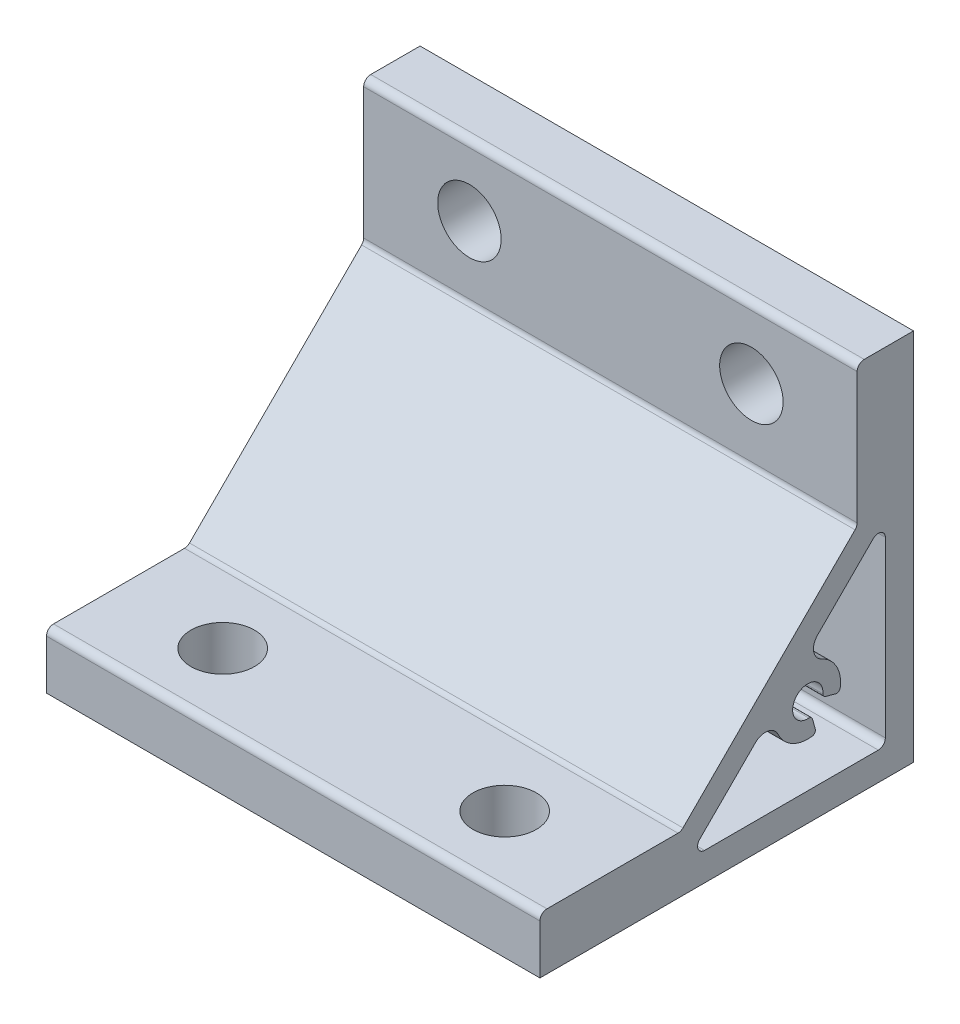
ISO-10303-21;
HEADER;
FILE_DESCRIPTION(('STEP AP214'),'2;1');
FILE_NAME('part.step','',(''),(''),'','','');
FILE_SCHEMA(('AUTOMOTIVE_DESIGN { 1 0 10303 214 1 1 1 1 }'));
ENDSEC;
DATA;
#1=APPLICATION_CONTEXT('core data for automotive mechanical design processes');
#2=APPLICATION_PROTOCOL_DEFINITION('international standard','automotive_design',2000,#1);
#3=PRODUCT_CONTEXT('',#1,'mechanical');
#4=PRODUCT('Part','Part','',(#3));
#5=PRODUCT_RELATED_PRODUCT_CATEGORY('part','',(#4));
#6=PRODUCT_DEFINITION_FORMATION('','',#4);
#7=PRODUCT_DEFINITION_CONTEXT('part definition',#1,'design');
#8=PRODUCT_DEFINITION('design','',#6,#7);
#9=PRODUCT_DEFINITION_SHAPE('','',#8);
#10=(LENGTH_UNIT() NAMED_UNIT(*) SI_UNIT(.MILLI.,.METRE.));
#11=(NAMED_UNIT(*) PLANE_ANGLE_UNIT() SI_UNIT($,.RADIAN.));
#12=(NAMED_UNIT(*) SI_UNIT($,.STERADIAN.) SOLID_ANGLE_UNIT());
#13=UNCERTAINTY_MEASURE_WITH_UNIT(LENGTH_MEASURE(1.E-05),#10,'distance_accuracy_value','');
#14=(GEOMETRIC_REPRESENTATION_CONTEXT(3) GLOBAL_UNCERTAINTY_ASSIGNED_CONTEXT((#13)) GLOBAL_UNIT_ASSIGNED_CONTEXT((#10,
#11,#12)) REPRESENTATION_CONTEXT('',''));
#15=CARTESIAN_POINT('',(0.,0.,0.));
#16=DIRECTION('',(0.,0.,1.));
#17=DIRECTION('',(1.,0.,0.));
#18=AXIS2_PLACEMENT_3D('',#15,#16,#17);
#19=CARTESIAN_POINT('',(35.,7.,52.));
#20=DIRECTION('',(1.,0.,0.));
#21=DIRECTION('',(0.,0.,-1.));
#22=AXIS2_PLACEMENT_3D('',#19,#20,#21);
#23=PLANE('',#22);
#24=DIRECTION('',(0.,-1.,0.));
#25=VECTOR('',#24,1.);
#26=CARTESIAN_POINT('',(35.,0.,53.));
#27=LINE('',#26,#25);
#28=CARTESIAN_POINT('',(35.,7.,53.));
#29=VERTEX_POINT('',#28);
#30=CARTESIAN_POINT('',(35.,0.,53.));
#31=VERTEX_POINT('',#30);
#32=EDGE_CURVE('E362',#29,#31,#27,.T.);
#33=ORIENTED_EDGE('',*,*,#32,.T.);
#34=DIRECTION('',(0.,0.,-1.));
#35=VECTOR('',#34,1.);
#36=CARTESIAN_POINT('',(35.,0.,53.));
#37=LINE('',#36,#35);
#38=CARTESIAN_POINT('',(35.,0.,0.));
#39=VERTEX_POINT('',#38);
#40=EDGE_CURVE('E365',#31,#39,#37,.T.);
#41=ORIENTED_EDGE('',*,*,#40,.T.);
#42=DIRECTION('',(0.,1.,0.));
#43=VECTOR('',#42,1.);
#44=CARTESIAN_POINT('',(35.,0.,0.));
#45=LINE('',#44,#43);
#46=CARTESIAN_POINT('',(35.,53.,0.));
#47=VERTEX_POINT('',#46);
#48=EDGE_CURVE('E368',#39,#47,#45,.T.);
#49=ORIENTED_EDGE('',*,*,#48,.T.);
#50=DIRECTION('',(0.,0.,1.));
#51=VECTOR('',#50,1.);
#52=CARTESIAN_POINT('',(35.,53.,6.99999999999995));
#53=LINE('',#52,#51);
#54=CARTESIAN_POINT('',(35.,53.,6.99999999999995));
#55=VERTEX_POINT('',#54);
#56=EDGE_CURVE('E370',#47,#55,#53,.T.);
#57=ORIENTED_EDGE('',*,*,#56,.T.);
#58=CARTESIAN_POINT('',(35.,52.,6.99999999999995));
#59=DIRECTION('',(1.,0.,0.));
#60=DIRECTION('',(0.,0.,-1.));
#61=AXIS2_PLACEMENT_3D('',#58,#59,#60);
#62=CIRCLE('',#61,1.);
#63=CARTESIAN_POINT('',(35.,52.,7.99999999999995));
#64=VERTEX_POINT('',#63);
#65=EDGE_CURVE('E372',#55,#64,#62,.T.);
#66=ORIENTED_EDGE('',*,*,#65,.T.);
#67=DIRECTION('',(0.,-1.,0.));
#68=VECTOR('',#67,1.);
#69=CARTESIAN_POINT('',(35.,33.4142135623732,7.99999999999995));
#70=LINE('',#69,#68);
#71=CARTESIAN_POINT('',(35.,33.4142135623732,7.99999999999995));
#72=VERTEX_POINT('',#71);
#73=EDGE_CURVE('E374',#64,#72,#70,.T.);
#74=ORIENTED_EDGE('',*,*,#73,.T.);
#75=CARTESIAN_POINT('',(35.,33.4142135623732,8.99999999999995));
#76=DIRECTION('',(-1.,0.,0.));
#77=DIRECTION('',(0.,0.,-1.));
#78=AXIS2_PLACEMENT_3D('',#75,#76,#77);
#79=CIRCLE('',#78,0.999999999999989);
#80=CARTESIAN_POINT('',(35.,32.7071067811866,8.29289321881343));
#81=VERTEX_POINT('',#80);
#82=EDGE_CURVE('E376',#72,#81,#79,.T.);
#83=ORIENTED_EDGE('',*,*,#82,.T.);
#84=DIRECTION('',(0.,-0.707106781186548,0.707106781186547));
#85=VECTOR('',#84,1.);
#86=CARTESIAN_POINT('',(35.,32.7071067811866,8.29289321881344));
#87=LINE('',#86,#85);
#88=CARTESIAN_POINT('',(35.,8.29289321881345,32.7071067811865));
#89=VERTEX_POINT('',#88);
#90=EDGE_CURVE('E378',#81,#89,#87,.T.);
#91=ORIENTED_EDGE('',*,*,#90,.T.);
#92=CARTESIAN_POINT('',(35.,9.,33.4142135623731));
#93=DIRECTION('',(-1.,0.,0.));
#94=DIRECTION('',(0.,0.,-1.));
#95=AXIS2_PLACEMENT_3D('',#92,#93,#94);
#96=CIRCLE('',#95,0.999999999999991);
#97=CARTESIAN_POINT('',(35.,8.00000000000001,33.4142135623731));
#98=VERTEX_POINT('',#97);
#99=EDGE_CURVE('E380',#89,#98,#96,.T.);
#100=ORIENTED_EDGE('',*,*,#99,.T.);
#101=DIRECTION('',(0.,0.,1.));
#102=VECTOR('',#101,1.);
#103=CARTESIAN_POINT('',(35.,8.,52.));
#104=LINE('',#103,#102);
#105=CARTESIAN_POINT('',(35.,8.,52.));
#106=VERTEX_POINT('',#105);
#107=EDGE_CURVE('E382',#98,#106,#104,.T.);
#108=ORIENTED_EDGE('',*,*,#107,.T.);
#109=CARTESIAN_POINT('',(35.,7.,52.));
#110=DIRECTION('',(1.,0.,0.));
#111=DIRECTION('',(0.,0.,-1.));
#112=AXIS2_PLACEMENT_3D('',#109,#110,#111);
#113=CIRCLE('',#112,1.);
#114=EDGE_CURVE('E384',#106,#29,#113,.T.);
#115=ORIENTED_EDGE('',*,*,#114,.T.);
#116=EDGE_LOOP('',(#33,#41,#49,#57,#66,#74,#83,#91,#100,#108,#115));
#117=FACE_BOUND('',#116,.T.);
#118=DIRECTION('',(0.,-0.707106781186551,0.707106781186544));
#119=VECTOR('',#118,1.);
#120=CARTESIAN_POINT('',(35.,30.3431457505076,5.70710678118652));
#121=LINE('',#120,#119);
#122=CARTESIAN_POINT('',(35.,30.3431457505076,5.70710678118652));
#123=VERTEX_POINT('',#122);
#124=CARTESIAN_POINT('',(35.,22.442841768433,13.6074107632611));
#125=VERTEX_POINT('',#124);
#126=EDGE_CURVE('E233',#123,#125,#121,.T.);
#127=ORIENTED_EDGE('',*,*,#126,.F.);
#128=CARTESIAN_POINT('',(35.,29.6360389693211,4.99999999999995));
#129=DIRECTION('',(1.,0.,0.));
#130=DIRECTION('',(0.,0.,-1.));
#131=AXIS2_PLACEMENT_3D('',#128,#129,#130);
#132=CIRCLE('',#131,1.00000000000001);
#133=CARTESIAN_POINT('',(35.,29.6360389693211,3.99999999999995));
#134=VERTEX_POINT('',#133);
#135=EDGE_CURVE('E225',#134,#123,#132,.T.);
#136=ORIENTED_EDGE('',*,*,#135,.F.);
#137=DIRECTION('',(0.,1.,0.));
#138=VECTOR('',#137,1.);
#139=CARTESIAN_POINT('',(35.,5.,3.99999999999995));
#140=LINE('',#139,#138);
#141=CARTESIAN_POINT('',(35.,5.,3.99999999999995));
#142=VERTEX_POINT('',#141);
#143=EDGE_CURVE('E279',#142,#134,#140,.T.);
#144=ORIENTED_EDGE('',*,*,#143,.F.);
#145=CARTESIAN_POINT('',(35.,5.,4.99999999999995));
#146=DIRECTION('',(1.,0.,0.));
#147=DIRECTION('',(0.,0.,-1.));
#148=AXIS2_PLACEMENT_3D('',#145,#146,#147);
#149=CIRCLE('',#148,1.);
#150=CARTESIAN_POINT('',(35.,4.,4.99999999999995));
#151=VERTEX_POINT('',#150);
#152=EDGE_CURVE('E277',#151,#142,#149,.T.);
#153=ORIENTED_EDGE('',*,*,#152,.F.);
#154=DIRECTION('',(0.,0.,-1.));
#155=VECTOR('',#154,1.);
#156=CARTESIAN_POINT('',(35.,4.,29.636038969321));
#157=LINE('',#156,#155);
#158=CARTESIAN_POINT('',(35.,3.99999999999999,29.636038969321));
#159=VERTEX_POINT('',#158);
#160=EDGE_CURVE('E275',#159,#151,#157,.T.);
#161=ORIENTED_EDGE('',*,*,#160,.F.);
#162=CARTESIAN_POINT('',(35.,5.,29.636038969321));
#163=DIRECTION('',(1.,0.,0.));
#164=DIRECTION('',(0.,0.,-1.));
#165=AXIS2_PLACEMENT_3D('',#162,#163,#164);
#166=CIRCLE('',#165,1.00000000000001);
#167=CARTESIAN_POINT('',(35.,5.70710678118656,30.3431457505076));
#168=VERTEX_POINT('',#167);
#169=EDGE_CURVE('E273',#168,#159,#166,.T.);
#170=ORIENTED_EDGE('',*,*,#169,.F.);
#171=DIRECTION('',(0.,-0.707106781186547,0.707106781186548));
#172=VECTOR('',#171,1.);
#173=CARTESIAN_POINT('',(35.,13.6074107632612,22.442841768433));
#174=LINE('',#173,#172);
#175=CARTESIAN_POINT('',(35.,13.6074107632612,22.442841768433));
#176=VERTEX_POINT('',#175);
#177=EDGE_CURVE('E271',#176,#168,#174,.T.);
#178=ORIENTED_EDGE('',*,*,#177,.F.);
#179=CARTESIAN_POINT('',(35.,12.1931972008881,21.0286282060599));
#180=DIRECTION('',(1.,0.,0.));
#181=DIRECTION('',(0.,0.,-1.));
#182=AXIS2_PLACEMENT_3D('',#179,#180,#181);
#183=CIRCLE('',#182,1.99999999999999);
#184=CARTESIAN_POINT('',(35.,13.0373484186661,19.2155069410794));
#185=VERTEX_POINT('',#184);
#186=EDGE_CURVE('E269',#185,#176,#183,.T.);
#187=ORIENTED_EDGE('',*,*,#186,.F.);
#188=CARTESIAN_POINT('',(35.,15.,15.));
#189=DIRECTION('',(-1.,0.,0.));
#190=DIRECTION('',(0.,0.,-1.));
#191=AXIS2_PLACEMENT_3D('',#188,#189,#190);
#192=CIRCLE('',#191,4.65000000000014);
#193=CARTESIAN_POINT('',(35.,10.3961625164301,14.3464095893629));
#194=VERTEX_POINT('',#193);
#195=EDGE_CURVE('E267',#194,#185,#192,.T.);
#196=ORIENTED_EDGE('',*,*,#195,.F.);
#197=CARTESIAN_POINT('',(35.,10.8911988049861,14.416688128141));
#198=DIRECTION('',(-1.,0.,0.));
#199=DIRECTION('',(0.,0.,-1.));
#200=AXIS2_PLACEMENT_3D('',#197,#198,#199);
#201=CIRCLE('',#200,0.500000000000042);
#202=CARTESIAN_POINT('',(35.,11.0206083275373,13.9337252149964));
#203=VERTEX_POINT('',#202);
#204=EDGE_CURVE('E265',#203,#194,#201,.T.);
#205=ORIENTED_EDGE('',*,*,#204,.F.);
#206=DIRECTION('',(0.,-0.965925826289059,-0.258819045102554));
#207=VECTOR('',#206,1.);
#208=CARTESIAN_POINT('',(35.,11.0206083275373,13.9337252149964));
#209=LINE('',#208,#207);
#210=CARTESIAN_POINT('',(35.,12.4862719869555,14.3264486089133));
#211=VERTEX_POINT('',#210);
#212=EDGE_CURVE('E263',#211,#203,#209,.T.);
#213=ORIENTED_EDGE('',*,*,#212,.F.);
#214=CARTESIAN_POINT('',(35.,12.3568624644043,14.8094115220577));
#215=DIRECTION('',(-1.,0.,0.));
#216=DIRECTION('',(0.,0.,-1.));
#217=AXIS2_PLACEMENT_3D('',#214,#215,#216);
#218=CIRCLE('',#217,0.499999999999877);
#219=CARTESIAN_POINT('',(35.,12.8555676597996,14.8453716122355));
#220=VERTEX_POINT('',#219);
#221=EDGE_CURVE('E261',#220,#211,#218,.T.);
#222=ORIENTED_EDGE('',*,*,#221,.F.);
#223=CARTESIAN_POINT('',(35.,15.,15.));
#224=DIRECTION('',(1.,0.,0.));
#225=DIRECTION('',(0.,0.,-1.));
#226=AXIS2_PLACEMENT_3D('',#223,#224,#225);
#227=CIRCLE('',#226,2.15);
#228=CARTESIAN_POINT('',(35.,14.8453716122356,12.8555676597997));
#229=VERTEX_POINT('',#228);
#230=EDGE_CURVE('E259',#229,#220,#227,.T.);
#231=ORIENTED_EDGE('',*,*,#230,.F.);
#232=CARTESIAN_POINT('',(35.,14.8094115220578,12.3568624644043));
#233=DIRECTION('',(-1.,0.,0.));
#234=DIRECTION('',(0.,0.,-1.));
#235=AXIS2_PLACEMENT_3D('',#232,#233,#234);
#236=CIRCLE('',#235,0.499999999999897);
#237=CARTESIAN_POINT('',(35.,14.3264486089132,12.4862719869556));
#238=VERTEX_POINT('',#237);
#239=EDGE_CURVE('E257',#238,#229,#236,.T.);
#240=ORIENTED_EDGE('',*,*,#239,.F.);
#241=DIRECTION('',(0.,0.258819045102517,0.965925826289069));
#242=VECTOR('',#241,1.);
#243=CARTESIAN_POINT('',(35.,13.9337252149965,11.0206083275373));
#244=LINE('',#243,#242);
#245=CARTESIAN_POINT('',(35.,13.9337252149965,11.0206083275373));
#246=VERTEX_POINT('',#245);
#247=EDGE_CURVE('E255',#246,#238,#244,.T.);
#248=ORIENTED_EDGE('',*,*,#247,.F.);
#249=CARTESIAN_POINT('',(35.,14.416688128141,10.891198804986));
#250=DIRECTION('',(-1.,0.,0.));
#251=DIRECTION('',(0.,0.,-1.));
#252=AXIS2_PLACEMENT_3D('',#249,#250,#251);
#253=CIRCLE('',#252,0.500000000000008);
#254=CARTESIAN_POINT('',(35.,14.3464095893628,10.3961625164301));
#255=VERTEX_POINT('',#254);
#256=EDGE_CURVE('E253',#255,#246,#253,.T.);
#257=ORIENTED_EDGE('',*,*,#256,.F.);
#258=CARTESIAN_POINT('',(35.,15.,15.));
#259=DIRECTION('',(-1.,0.,0.));
#260=DIRECTION('',(0.,0.,-1.));
#261=AXIS2_PLACEMENT_3D('',#258,#259,#260);
#262=CIRCLE('',#261,4.64999999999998);
#263=CARTESIAN_POINT('',(35.,19.2155069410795,13.0373484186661));
#264=VERTEX_POINT('',#263);
#265=EDGE_CURVE('E248',#264,#255,#262,.T.);
#266=ORIENTED_EDGE('',*,*,#265,.F.);
#267=CARTESIAN_POINT('',(35.,21.0286282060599,12.193197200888));
#268=DIRECTION('',(1.,0.,0.));
#269=DIRECTION('',(0.,0.,-1.));
#270=AXIS2_PLACEMENT_3D('',#267,#268,#269);
#271=CIRCLE('',#270,2.00000000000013);
#272=EDGE_CURVE('E246',#125,#264,#271,.T.);
#273=ORIENTED_EDGE('',*,*,#272,.F.);
#274=EDGE_LOOP('',(#127,#136,#144,#153,#161,#170,#178,#187,#196,#205,#213,#222,#231,#240,#248,
#257,#266,#273));
#275=FACE_BOUND('',#274,.T.);
#276=ADVANCED_FACE('F34',(#117,#275),#23,.T.);
#277=CARTESIAN_POINT('',(-35.,7.,52.));
#278=DIRECTION('',(1.,0.,0.));
#279=DIRECTION('',(0.,0.,-1.));
#280=AXIS2_PLACEMENT_3D('',#277,#278,#279);
#281=PLANE('',#280);
#282=DIRECTION('',(0.,-1.,0.));
#283=VECTOR('',#282,1.);
#284=CARTESIAN_POINT('',(-35.,0.,53.));
#285=LINE('',#284,#283);
#286=CARTESIAN_POINT('',(-35.,7.,53.));
#287=VERTEX_POINT('',#286);
#288=CARTESIAN_POINT('',(-35.,0.,53.));
#289=VERTEX_POINT('',#288);
#290=EDGE_CURVE('E241',#287,#289,#285,.T.);
#291=ORIENTED_EDGE('',*,*,#290,.F.);
#292=CARTESIAN_POINT('',(-35.,7.,52.));
#293=DIRECTION('',(1.,0.,0.));
#294=DIRECTION('',(0.,0.,-1.));
#295=AXIS2_PLACEMENT_3D('',#292,#293,#294);
#296=CIRCLE('',#295,1.);
#297=CARTESIAN_POINT('',(-35.,8.,52.));
#298=VERTEX_POINT('',#297);
#299=EDGE_CURVE('E366',#298,#287,#296,.T.);
#300=ORIENTED_EDGE('',*,*,#299,.F.);
#301=DIRECTION('',(0.,0.,1.));
#302=VECTOR('',#301,1.);
#303=CARTESIAN_POINT('',(-35.,8.,52.));
#304=LINE('',#303,#302);
#305=CARTESIAN_POINT('',(-35.,8.00000000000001,33.4142135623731));
#306=VERTEX_POINT('',#305);
#307=EDGE_CURVE('E405',#306,#298,#304,.T.);
#308=ORIENTED_EDGE('',*,*,#307,.F.);
#309=CARTESIAN_POINT('',(-35.,9.,33.4142135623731));
#310=DIRECTION('',(-1.,0.,0.));
#311=DIRECTION('',(0.,0.,-1.));
#312=AXIS2_PLACEMENT_3D('',#309,#310,#311);
#313=CIRCLE('',#312,0.999999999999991);
#314=CARTESIAN_POINT('',(-35.,8.29289321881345,32.7071067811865));
#315=VERTEX_POINT('',#314);
#316=EDGE_CURVE('E403',#315,#306,#313,.T.);
#317=ORIENTED_EDGE('',*,*,#316,.F.);
#318=DIRECTION('',(0.,-0.707106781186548,0.707106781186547));
#319=VECTOR('',#318,1.);
#320=CARTESIAN_POINT('',(-35.,32.7071067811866,8.29289321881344));
#321=LINE('',#320,#319);
#322=CARTESIAN_POINT('',(-35.,32.7071067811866,8.29289321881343));
#323=VERTEX_POINT('',#322);
#324=EDGE_CURVE('E401',#323,#315,#321,.T.);
#325=ORIENTED_EDGE('',*,*,#324,.F.);
#326=CARTESIAN_POINT('',(-35.,33.4142135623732,8.99999999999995));
#327=DIRECTION('',(-1.,0.,0.));
#328=DIRECTION('',(0.,0.,-1.));
#329=AXIS2_PLACEMENT_3D('',#326,#327,#328);
#330=CIRCLE('',#329,0.999999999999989);
#331=CARTESIAN_POINT('',(-35.,33.4142135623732,7.99999999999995));
#332=VERTEX_POINT('',#331);
#333=EDGE_CURVE('E399',#332,#323,#330,.T.);
#334=ORIENTED_EDGE('',*,*,#333,.F.);
#335=DIRECTION('',(0.,-1.,0.));
#336=VECTOR('',#335,1.);
#337=CARTESIAN_POINT('',(-35.,33.4142135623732,7.99999999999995));
#338=LINE('',#337,#336);
#339=CARTESIAN_POINT('',(-35.,52.,7.99999999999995));
#340=VERTEX_POINT('',#339);
#341=EDGE_CURVE('E397',#340,#332,#338,.T.);
#342=ORIENTED_EDGE('',*,*,#341,.F.);
#343=CARTESIAN_POINT('',(-35.,52.,6.99999999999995));
#344=DIRECTION('',(1.,0.,0.));
#345=DIRECTION('',(0.,0.,-1.));
#346=AXIS2_PLACEMENT_3D('',#343,#344,#345);
#347=CIRCLE('',#346,1.);
#348=CARTESIAN_POINT('',(-35.,53.,6.99999999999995));
#349=VERTEX_POINT('',#348);
#350=EDGE_CURVE('E395',#349,#340,#347,.T.);
#351=ORIENTED_EDGE('',*,*,#350,.F.);
#352=DIRECTION('',(0.,0.,1.));
#353=VECTOR('',#352,1.);
#354=CARTESIAN_POINT('',(-35.,53.,6.99999999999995));
#355=LINE('',#354,#353);
#356=CARTESIAN_POINT('',(-35.,53.,0.));
#357=VERTEX_POINT('',#356);
#358=EDGE_CURVE('E393',#357,#349,#355,.T.);
#359=ORIENTED_EDGE('',*,*,#358,.F.);
#360=DIRECTION('',(0.,1.,0.));
#361=VECTOR('',#360,1.);
#362=CARTESIAN_POINT('',(-35.,0.,0.));
#363=LINE('',#362,#361);
#364=CARTESIAN_POINT('',(-35.,0.,0.));
#365=VERTEX_POINT('',#364);
#366=EDGE_CURVE('E391',#365,#357,#363,.T.);
#367=ORIENTED_EDGE('',*,*,#366,.F.);
#368=DIRECTION('',(0.,0.,-1.));
#369=VECTOR('',#368,1.);
#370=CARTESIAN_POINT('',(-35.,0.,53.));
#371=LINE('',#370,#369);
#372=EDGE_CURVE('E389',#289,#365,#371,.T.);
#373=ORIENTED_EDGE('',*,*,#372,.F.);
#374=EDGE_LOOP('',(#291,#300,#308,#317,#325,#334,#342,#351,#359,#367,#373));
#375=FACE_BOUND('',#374,.T.);
#376=CARTESIAN_POINT('',(-35.,29.6360389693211,4.99999999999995));
#377=DIRECTION('',(1.,0.,0.));
#378=DIRECTION('',(0.,0.,-1.));
#379=AXIS2_PLACEMENT_3D('',#376,#377,#378);
#380=CIRCLE('',#379,1.00000000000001);
#381=CARTESIAN_POINT('',(-35.,29.6360389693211,3.99999999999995));
#382=VERTEX_POINT('',#381);
#383=CARTESIAN_POINT('',(-35.,30.3431457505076,5.70710678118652));
#384=VERTEX_POINT('',#383);
#385=EDGE_CURVE('E57',#382,#384,#380,.T.);
#386=ORIENTED_EDGE('',*,*,#385,.T.);
#387=DIRECTION('',(0.,-0.707106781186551,0.707106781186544));
#388=VECTOR('',#387,1.);
#389=CARTESIAN_POINT('',(-35.,30.3431457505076,5.70710678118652));
#390=LINE('',#389,#388);
#391=CARTESIAN_POINT('',(-35.,22.442841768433,13.6074107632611));
#392=VERTEX_POINT('',#391);
#393=EDGE_CURVE('E240',#384,#392,#390,.T.);
#394=ORIENTED_EDGE('',*,*,#393,.T.);
#395=CARTESIAN_POINT('',(-35.,21.0286282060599,12.193197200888));
#396=DIRECTION('',(1.,0.,0.));
#397=DIRECTION('',(0.,0.,-1.));
#398=AXIS2_PLACEMENT_3D('',#395,#396,#397);
#399=CIRCLE('',#398,2.00000000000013);
#400=CARTESIAN_POINT('',(-35.,19.2155069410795,13.0373484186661));
#401=VERTEX_POINT('',#400);
#402=EDGE_CURVE('E284',#392,#401,#399,.T.);
#403=ORIENTED_EDGE('',*,*,#402,.T.);
#404=CARTESIAN_POINT('',(-35.,15.,15.));
#405=DIRECTION('',(-1.,0.,0.));
#406=DIRECTION('',(0.,0.,-1.));
#407=AXIS2_PLACEMENT_3D('',#404,#405,#406);
#408=CIRCLE('',#407,4.64999999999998);
#409=CARTESIAN_POINT('',(-35.,14.3464095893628,10.3961625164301));
#410=VERTEX_POINT('',#409);
#411=EDGE_CURVE('E287',#401,#410,#408,.T.);
#412=ORIENTED_EDGE('',*,*,#411,.T.);
#413=CARTESIAN_POINT('',(-35.,14.416688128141,10.891198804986));
#414=DIRECTION('',(-1.,0.,0.));
#415=DIRECTION('',(0.,0.,-1.));
#416=AXIS2_PLACEMENT_3D('',#413,#414,#415);
#417=CIRCLE('',#416,0.500000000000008);
#418=CARTESIAN_POINT('',(-35.,13.9337252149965,11.0206083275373));
#419=VERTEX_POINT('',#418);
#420=EDGE_CURVE('E290',#410,#419,#417,.T.);
#421=ORIENTED_EDGE('',*,*,#420,.T.);
#422=DIRECTION('',(0.,0.258819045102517,0.965925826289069));
#423=VECTOR('',#422,1.);
#424=CARTESIAN_POINT('',(-35.,13.9337252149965,11.0206083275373));
#425=LINE('',#424,#423);
#426=CARTESIAN_POINT('',(-35.,14.3264486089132,12.4862719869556));
#427=VERTEX_POINT('',#426);
#428=EDGE_CURVE('E293',#419,#427,#425,.T.);
#429=ORIENTED_EDGE('',*,*,#428,.T.);
#430=CARTESIAN_POINT('',(-35.,14.8094115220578,12.3568624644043));
#431=DIRECTION('',(-1.,0.,0.));
#432=DIRECTION('',(0.,0.,-1.));
#433=AXIS2_PLACEMENT_3D('',#430,#431,#432);
#434=CIRCLE('',#433,0.499999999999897);
#435=CARTESIAN_POINT('',(-35.,14.8453716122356,12.8555676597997));
#436=VERTEX_POINT('',#435);
#437=EDGE_CURVE('E296',#427,#436,#434,.T.);
#438=ORIENTED_EDGE('',*,*,#437,.T.);
#439=CARTESIAN_POINT('',(-35.,15.,15.));
#440=DIRECTION('',(1.,0.,0.));
#441=DIRECTION('',(0.,0.,-1.));
#442=AXIS2_PLACEMENT_3D('',#439,#440,#441);
#443=CIRCLE('',#442,2.15);
#444=CARTESIAN_POINT('',(-35.,12.8555676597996,14.8453716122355));
#445=VERTEX_POINT('',#444);
#446=EDGE_CURVE('E299',#436,#445,#443,.T.);
#447=ORIENTED_EDGE('',*,*,#446,.T.);
#448=CARTESIAN_POINT('',(-35.,12.3568624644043,14.8094115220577));
#449=DIRECTION('',(-1.,0.,0.));
#450=DIRECTION('',(0.,0.,-1.));
#451=AXIS2_PLACEMENT_3D('',#448,#449,#450);
#452=CIRCLE('',#451,0.499999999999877);
#453=CARTESIAN_POINT('',(-35.,12.4862719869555,14.3264486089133));
#454=VERTEX_POINT('',#453);
#455=EDGE_CURVE('E302',#445,#454,#452,.T.);
#456=ORIENTED_EDGE('',*,*,#455,.T.);
#457=DIRECTION('',(0.,-0.965925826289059,-0.258819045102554));
#458=VECTOR('',#457,1.);
#459=CARTESIAN_POINT('',(-35.,11.0206083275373,13.9337252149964));
#460=LINE('',#459,#458);
#461=CARTESIAN_POINT('',(-35.,11.0206083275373,13.9337252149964));
#462=VERTEX_POINT('',#461);
#463=EDGE_CURVE('E305',#454,#462,#460,.T.);
#464=ORIENTED_EDGE('',*,*,#463,.T.);
#465=CARTESIAN_POINT('',(-35.,10.8911988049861,14.416688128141));
#466=DIRECTION('',(-1.,0.,0.));
#467=DIRECTION('',(0.,0.,-1.));
#468=AXIS2_PLACEMENT_3D('',#465,#466,#467);
#469=CIRCLE('',#468,0.500000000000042);
#470=CARTESIAN_POINT('',(-35.,10.3961625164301,14.3464095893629));
#471=VERTEX_POINT('',#470);
#472=EDGE_CURVE('E308',#462,#471,#469,.T.);
#473=ORIENTED_EDGE('',*,*,#472,.T.);
#474=CARTESIAN_POINT('',(-35.,15.,15.));
#475=DIRECTION('',(-1.,0.,0.));
#476=DIRECTION('',(0.,0.,-1.));
#477=AXIS2_PLACEMENT_3D('',#474,#475,#476);
#478=CIRCLE('',#477,4.65000000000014);
#479=CARTESIAN_POINT('',(-35.,13.0373484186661,19.2155069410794));
#480=VERTEX_POINT('',#479);
#481=EDGE_CURVE('E311',#471,#480,#478,.T.);
#482=ORIENTED_EDGE('',*,*,#481,.T.);
#483=CARTESIAN_POINT('',(-35.,12.1931972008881,21.0286282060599));
#484=DIRECTION('',(1.,0.,0.));
#485=DIRECTION('',(0.,0.,-1.));
#486=AXIS2_PLACEMENT_3D('',#483,#484,#485);
#487=CIRCLE('',#486,1.99999999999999);
#488=CARTESIAN_POINT('',(-35.,13.6074107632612,22.442841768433));
#489=VERTEX_POINT('',#488);
#490=EDGE_CURVE('E314',#480,#489,#487,.T.);
#491=ORIENTED_EDGE('',*,*,#490,.T.);
#492=DIRECTION('',(0.,-0.707106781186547,0.707106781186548));
#493=VECTOR('',#492,1.);
#494=CARTESIAN_POINT('',(-35.,13.6074107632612,22.442841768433));
#495=LINE('',#494,#493);
#496=CARTESIAN_POINT('',(-35.,5.70710678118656,30.3431457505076));
#497=VERTEX_POINT('',#496);
#498=EDGE_CURVE('E317',#489,#497,#495,.T.);
#499=ORIENTED_EDGE('',*,*,#498,.T.);
#500=CARTESIAN_POINT('',(-35.,5.,29.636038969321));
#501=DIRECTION('',(1.,0.,0.));
#502=DIRECTION('',(0.,0.,-1.));
#503=AXIS2_PLACEMENT_3D('',#500,#501,#502);
#504=CIRCLE('',#503,1.00000000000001);
#505=CARTESIAN_POINT('',(-35.,3.99999999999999,29.636038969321));
#506=VERTEX_POINT('',#505);
#507=EDGE_CURVE('E320',#497,#506,#504,.T.);
#508=ORIENTED_EDGE('',*,*,#507,.T.);
#509=DIRECTION('',(0.,0.,-1.));
#510=VECTOR('',#509,1.);
#511=CARTESIAN_POINT('',(-35.,4.,29.636038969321));
#512=LINE('',#511,#510);
#513=CARTESIAN_POINT('',(-35.,4.,4.99999999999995));
#514=VERTEX_POINT('',#513);
#515=EDGE_CURVE('E323',#506,#514,#512,.T.);
#516=ORIENTED_EDGE('',*,*,#515,.T.);
#517=CARTESIAN_POINT('',(-35.,5.,4.99999999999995));
#518=DIRECTION('',(1.,0.,0.));
#519=DIRECTION('',(0.,0.,-1.));
#520=AXIS2_PLACEMENT_3D('',#517,#518,#519);
#521=CIRCLE('',#520,1.);
#522=CARTESIAN_POINT('',(-35.,5.,3.99999999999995));
#523=VERTEX_POINT('',#522);
#524=EDGE_CURVE('E326',#514,#523,#521,.T.);
#525=ORIENTED_EDGE('',*,*,#524,.T.);
#526=DIRECTION('',(0.,1.,0.));
#527=VECTOR('',#526,1.);
#528=CARTESIAN_POINT('',(-35.,5.,3.99999999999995));
#529=LINE('',#528,#527);
#530=EDGE_CURVE('E234',#523,#382,#529,.T.);
#531=ORIENTED_EDGE('',*,*,#530,.T.);
#532=EDGE_LOOP('',(#386,#394,#403,#412,#421,#429,#438,#447,#456,#464,#473,#482,#491,#499,#508,
#516,#525,#531));
#533=FACE_BOUND('',#532,.T.);
#534=ADVANCED_FACE('F444',(#375,#533),#281,.F.);
#535=CARTESIAN_POINT('',(35.,0.,53.));
#536=DIRECTION('',(0.,0.,-1.));
#537=DIRECTION('',(-1.,0.,0.));
#538=AXIS2_PLACEMENT_3D('',#535,#536,#537);
#539=PLANE('',#538);
#540=ORIENTED_EDGE('',*,*,#290,.T.);
#541=DIRECTION('',(-1.,0.,0.));
#542=VECTOR('',#541,1.);
#543=CARTESIAN_POINT('',(35.,0.,53.));
#544=LINE('',#543,#542);
#545=EDGE_CURVE('E11',#31,#289,#544,.T.);
#546=ORIENTED_EDGE('',*,*,#545,.F.);
#547=ORIENTED_EDGE('',*,*,#32,.F.);
#548=DIRECTION('',(-1.,0.,0.));
#549=VECTOR('',#548,1.);
#550=CARTESIAN_POINT('',(35.,7.,53.));
#551=LINE('',#550,#549);
#552=EDGE_CURVE('E386',#29,#287,#551,.T.);
#553=ORIENTED_EDGE('',*,*,#552,.T.);
#554=EDGE_LOOP('',(#540,#546,#547,#553));
#555=FACE_BOUND('',#554,.T.);
#556=ADVANCED_FACE('F36',(#555),#539,.F.);
#557=CARTESIAN_POINT('',(35.,0.,53.));
#558=DIRECTION('',(0.,1.,0.));
#559=DIRECTION('',(0.,0.,1.));
#560=AXIS2_PLACEMENT_3D('',#557,#558,#559);
#561=PLANE('',#560);
#562=CARTESIAN_POINT('',(-20.,0.,43.));
#563=DIRECTION('',(0.,1.,0.));
#564=DIRECTION('',(0.,0.,1.));
#565=AXIS2_PLACEMENT_3D('',#562,#563,#564);
#566=CIRCLE('',#565,4.5);
#567=CARTESIAN_POINT('',(-20.,0.,47.5));
#568=VERTEX_POINT('',#567);
#569=EDGE_CURVE('E816',#568,#568,#566,.T.);
#570=ORIENTED_EDGE('',*,*,#569,.T.);
#571=EDGE_LOOP('',(#570));
#572=FACE_BOUND('',#571,.T.);
#573=CARTESIAN_POINT('',(20.,0.,43.));
#574=DIRECTION('',(0.,1.,0.));
#575=DIRECTION('',(0.,0.,1.));
#576=AXIS2_PLACEMENT_3D('',#573,#574,#575);
#577=CIRCLE('',#576,4.5);
#578=CARTESIAN_POINT('',(20.,0.,47.5));
#579=VERTEX_POINT('',#578);
#580=EDGE_CURVE('E819',#579,#579,#577,.T.);
#581=ORIENTED_EDGE('',*,*,#580,.T.);
#582=EDGE_LOOP('',(#581));
#583=FACE_BOUND('',#582,.T.);
#584=ORIENTED_EDGE('',*,*,#372,.T.);
#585=DIRECTION('',(-1.,0.,0.));
#586=VECTOR('',#585,1.);
#587=CARTESIAN_POINT('',(35.,0.,0.));
#588=LINE('',#587,#586);
#589=EDGE_CURVE('E42',#39,#365,#588,.T.);
#590=ORIENTED_EDGE('',*,*,#589,.F.);
#591=ORIENTED_EDGE('',*,*,#40,.F.);
#592=ORIENTED_EDGE('',*,*,#545,.T.);
#593=EDGE_LOOP('',(#584,#590,#591,#592));
#594=FACE_BOUND('',#593,.T.);
#595=ADVANCED_FACE('F461',(#572,#583,#594),#561,.F.);
#596=CARTESIAN_POINT('',(35.,0.,0.));
#597=DIRECTION('',(0.,0.,1.));
#598=DIRECTION('',(1.,0.,0.));
#599=AXIS2_PLACEMENT_3D('',#596,#597,#598);
#600=PLANE('',#599);
#601=CARTESIAN_POINT('',(-20.,43.,0.));
#602=DIRECTION('',(0.,0.,1.));
#603=DIRECTION('',(1.,0.,0.));
#604=AXIS2_PLACEMENT_3D('',#601,#602,#603);
#605=CIRCLE('',#604,4.5);
#606=CARTESIAN_POINT('',(-15.5,43.,0.));
#607=VERTEX_POINT('',#606);
#608=EDGE_CURVE('E824',#607,#607,#605,.T.);
#609=ORIENTED_EDGE('',*,*,#608,.T.);
#610=EDGE_LOOP('',(#609));
#611=FACE_BOUND('',#610,.T.);
#612=CARTESIAN_POINT('',(20.,43.,0.));
#613=DIRECTION('',(0.,0.,1.));
#614=DIRECTION('',(1.,0.,0.));
#615=AXIS2_PLACEMENT_3D('',#612,#613,#614);
#616=CIRCLE('',#615,4.5);
#617=CARTESIAN_POINT('',(24.5,43.,0.));
#618=VERTEX_POINT('',#617);
#619=EDGE_CURVE('E282',#618,#618,#616,.T.);
#620=ORIENTED_EDGE('',*,*,#619,.T.);
#621=EDGE_LOOP('',(#620));
#622=FACE_BOUND('',#621,.T.);
#623=ORIENTED_EDGE('',*,*,#366,.T.);
#624=DIRECTION('',(-1.,0.,0.));
#625=VECTOR('',#624,1.);
#626=CARTESIAN_POINT('',(35.,53.,0.));
#627=LINE('',#626,#625);
#628=EDGE_CURVE('E431',#47,#357,#627,.T.);
#629=ORIENTED_EDGE('',*,*,#628,.F.);
#630=ORIENTED_EDGE('',*,*,#48,.F.);
#631=ORIENTED_EDGE('',*,*,#589,.T.);
#632=EDGE_LOOP('',(#623,#629,#630,#631));
#633=FACE_BOUND('',#632,.T.);
#634=ADVANCED_FACE('F438',(#611,#622,#633),#600,.F.);
#635=CARTESIAN_POINT('',(35.,53.,6.99999999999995));
#636=DIRECTION('',(0.,-1.,0.));
#637=DIRECTION('',(0.,0.,-1.));
#638=AXIS2_PLACEMENT_3D('',#635,#636,#637);
#639=PLANE('',#638);
#640=ORIENTED_EDGE('',*,*,#358,.T.);
#641=DIRECTION('',(-1.,0.,0.));
#642=VECTOR('',#641,1.);
#643=CARTESIAN_POINT('',(35.,53.,6.99999999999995));
#644=LINE('',#643,#642);
#645=EDGE_CURVE('E428',#55,#349,#644,.T.);
#646=ORIENTED_EDGE('',*,*,#645,.F.);
#647=ORIENTED_EDGE('',*,*,#56,.F.);
#648=ORIENTED_EDGE('',*,*,#628,.T.);
#649=EDGE_LOOP('',(#640,#646,#647,#648));
#650=FACE_BOUND('',#649,.T.);
#651=ADVANCED_FACE('F450',(#650),#639,.F.);
#652=CARTESIAN_POINT('',(35.,52.,6.99999999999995));
#653=DIRECTION('',(-1.,0.,0.));
#654=DIRECTION('',(0.,0.,1.));
#655=AXIS2_PLACEMENT_3D('',#652,#653,#654);
#656=CYLINDRICAL_SURFACE('',#655,1.);
#657=ORIENTED_EDGE('',*,*,#350,.T.);
#658=DIRECTION('',(-1.,0.,0.));
#659=VECTOR('',#658,1.);
#660=CARTESIAN_POINT('',(35.,52.,7.99999999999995));
#661=LINE('',#660,#659);
#662=EDGE_CURVE('E425',#64,#340,#661,.T.);
#663=ORIENTED_EDGE('',*,*,#662,.F.);
#664=ORIENTED_EDGE('',*,*,#65,.F.);
#665=ORIENTED_EDGE('',*,*,#645,.T.);
#666=EDGE_LOOP('',(#657,#663,#664,#665));
#667=FACE_BOUND('',#666,.T.);
#668=ADVANCED_FACE('F454',(#667),#656,.T.);
#669=CARTESIAN_POINT('',(35.,33.4142135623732,7.99999999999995));
#670=DIRECTION('',(0.,0.,-1.));
#671=DIRECTION('',(-1.,0.,0.));
#672=AXIS2_PLACEMENT_3D('',#669,#670,#671);
#673=PLANE('',#672);
#674=CARTESIAN_POINT('',(-20.,43.,7.99999999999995));
#675=DIRECTION('',(0.,0.,1.));
#676=DIRECTION('',(1.,0.,0.));
#677=AXIS2_PLACEMENT_3D('',#674,#675,#676);
#678=CIRCLE('',#677,4.5);
#679=CARTESIAN_POINT('',(-15.5,43.,7.99999999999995));
#680=VERTEX_POINT('',#679);
#681=EDGE_CURVE('E820',#680,#680,#678,.T.);
#682=ORIENTED_EDGE('',*,*,#681,.F.);
#683=EDGE_LOOP('',(#682));
#684=FACE_BOUND('',#683,.T.);
#685=CARTESIAN_POINT('',(20.,43.,7.99999999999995));
#686=DIRECTION('',(0.,0.,1.));
#687=DIRECTION('',(1.,0.,0.));
#688=AXIS2_PLACEMENT_3D('',#685,#686,#687);
#689=CIRCLE('',#688,4.5);
#690=CARTESIAN_POINT('',(24.5,43.,7.99999999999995));
#691=VERTEX_POINT('',#690);
#692=EDGE_CURVE('E832',#691,#691,#689,.T.);
#693=ORIENTED_EDGE('',*,*,#692,.F.);
#694=EDGE_LOOP('',(#693));
#695=FACE_BOUND('',#694,.T.);
#696=ORIENTED_EDGE('',*,*,#341,.T.);
#697=DIRECTION('',(-1.,0.,0.));
#698=VECTOR('',#697,1.);
#699=CARTESIAN_POINT('',(35.,33.4142135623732,7.99999999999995));
#700=LINE('',#699,#698);
#701=EDGE_CURVE('E422',#72,#332,#700,.T.);
#702=ORIENTED_EDGE('',*,*,#701,.F.);
#703=ORIENTED_EDGE('',*,*,#73,.F.);
#704=ORIENTED_EDGE('',*,*,#662,.T.);
#705=EDGE_LOOP('',(#696,#702,#703,#704));
#706=FACE_BOUND('',#705,.T.);
#707=ADVANCED_FACE('F489',(#684,#695,#706),#673,.F.);
#708=CARTESIAN_POINT('',(35.,33.4142135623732,8.99999999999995));
#709=DIRECTION('',(-1.,0.,0.));
#710=DIRECTION('',(0.,0.,1.));
#711=AXIS2_PLACEMENT_3D('',#708,#709,#710);
#712=CYLINDRICAL_SURFACE('',#711,0.999999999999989);
#713=ORIENTED_EDGE('',*,*,#333,.T.);
#714=DIRECTION('',(-1.,0.,0.));
#715=VECTOR('',#714,1.);
#716=CARTESIAN_POINT('',(35.,32.7071067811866,8.29289321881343));
#717=LINE('',#716,#715);
#718=EDGE_CURVE('E419',#81,#323,#717,.T.);
#719=ORIENTED_EDGE('',*,*,#718,.F.);
#720=ORIENTED_EDGE('',*,*,#82,.F.);
#721=ORIENTED_EDGE('',*,*,#701,.T.);
#722=EDGE_LOOP('',(#713,#719,#720,#721));
#723=FACE_BOUND('',#722,.T.);
#724=ADVANCED_FACE('F487',(#723),#712,.F.);
#725=CARTESIAN_POINT('',(35.,32.7071067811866,8.29289321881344));
#726=DIRECTION('',(0.,-0.707106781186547,-0.707106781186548));
#727=DIRECTION('',(0.,0.707106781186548,-0.707106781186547));
#728=AXIS2_PLACEMENT_3D('',#725,#726,#727);
#729=PLANE('',#728);
#730=ORIENTED_EDGE('',*,*,#324,.T.);
#731=DIRECTION('',(-1.,0.,0.));
#732=VECTOR('',#731,1.);
#733=CARTESIAN_POINT('',(35.,8.29289321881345,32.7071067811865));
#734=LINE('',#733,#732);
#735=EDGE_CURVE('E416',#89,#315,#734,.T.);
#736=ORIENTED_EDGE('',*,*,#735,.F.);
#737=ORIENTED_EDGE('',*,*,#90,.F.);
#738=ORIENTED_EDGE('',*,*,#718,.T.);
#739=EDGE_LOOP('',(#730,#736,#737,#738));
#740=FACE_BOUND('',#739,.T.);
#741=ADVANCED_FACE('F482',(#740),#729,.F.);
#742=CARTESIAN_POINT('',(35.,9.,33.4142135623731));
#743=DIRECTION('',(-1.,0.,0.));
#744=DIRECTION('',(0.,0.,1.));
#745=AXIS2_PLACEMENT_3D('',#742,#743,#744);
#746=CYLINDRICAL_SURFACE('',#745,0.999999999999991);
#747=ORIENTED_EDGE('',*,*,#316,.T.);
#748=DIRECTION('',(-1.,0.,0.));
#749=VECTOR('',#748,1.);
#750=CARTESIAN_POINT('',(35.,8.00000000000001,33.4142135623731));
#751=LINE('',#750,#749);
#752=EDGE_CURVE('E413',#98,#306,#751,.T.);
#753=ORIENTED_EDGE('',*,*,#752,.F.);
#754=ORIENTED_EDGE('',*,*,#99,.F.);
#755=ORIENTED_EDGE('',*,*,#735,.T.);
#756=EDGE_LOOP('',(#747,#753,#754,#755));
#757=FACE_BOUND('',#756,.T.);
#758=ADVANCED_FACE('F477',(#757),#746,.F.);
#759=CARTESIAN_POINT('',(35.,8.,52.));
#760=DIRECTION('',(0.,-1.,0.));
#761=DIRECTION('',(0.,0.,-1.));
#762=AXIS2_PLACEMENT_3D('',#759,#760,#761);
#763=PLANE('',#762);
#764=CARTESIAN_POINT('',(-20.,8.,43.));
#765=DIRECTION('',(0.,1.,0.));
#766=DIRECTION('',(0.,0.,1.));
#767=AXIS2_PLACEMENT_3D('',#764,#765,#766);
#768=CIRCLE('',#767,4.5);
#769=CARTESIAN_POINT('',(-20.,8.,47.5));
#770=VERTEX_POINT('',#769);
#771=EDGE_CURVE('E842',#770,#770,#768,.T.);
#772=ORIENTED_EDGE('',*,*,#771,.F.);
#773=EDGE_LOOP('',(#772));
#774=FACE_BOUND('',#773,.T.);
#775=CARTESIAN_POINT('',(20.,8.,43.));
#776=DIRECTION('',(0.,1.,0.));
#777=DIRECTION('',(0.,0.,1.));
#778=AXIS2_PLACEMENT_3D('',#775,#776,#777);
#779=CIRCLE('',#778,4.5);
#780=CARTESIAN_POINT('',(20.,8.,47.5));
#781=VERTEX_POINT('',#780);
#782=EDGE_CURVE('E821',#781,#781,#779,.T.);
#783=ORIENTED_EDGE('',*,*,#782,.F.);
#784=EDGE_LOOP('',(#783));
#785=FACE_BOUND('',#784,.T.);
#786=ORIENTED_EDGE('',*,*,#307,.T.);
#787=DIRECTION('',(-1.,0.,0.));
#788=VECTOR('',#787,1.);
#789=CARTESIAN_POINT('',(35.,8.,52.));
#790=LINE('',#789,#788);
#791=EDGE_CURVE('E410',#106,#298,#790,.T.);
#792=ORIENTED_EDGE('',*,*,#791,.F.);
#793=ORIENTED_EDGE('',*,*,#107,.F.);
#794=ORIENTED_EDGE('',*,*,#752,.T.);
#795=EDGE_LOOP('',(#786,#792,#793,#794));
#796=FACE_BOUND('',#795,.T.);
#797=ADVANCED_FACE('F473',(#774,#785,#796),#763,.F.);
#798=CARTESIAN_POINT('',(35.,7.,52.));
#799=DIRECTION('',(-1.,0.,0.));
#800=DIRECTION('',(0.,0.,1.));
#801=AXIS2_PLACEMENT_3D('',#798,#799,#800);
#802=CYLINDRICAL_SURFACE('',#801,1.);
#803=ORIENTED_EDGE('',*,*,#299,.T.);
#804=ORIENTED_EDGE('',*,*,#552,.F.);
#805=ORIENTED_EDGE('',*,*,#114,.F.);
#806=ORIENTED_EDGE('',*,*,#791,.T.);
#807=EDGE_LOOP('',(#803,#804,#805,#806));
#808=FACE_BOUND('',#807,.T.);
#809=ADVANCED_FACE('F468',(#808),#802,.T.);
#810=CARTESIAN_POINT('',(35.,29.6360389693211,4.99999999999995));
#811=DIRECTION('',(-1.,0.,0.));
#812=DIRECTION('',(0.,0.,1.));
#813=AXIS2_PLACEMENT_3D('',#810,#811,#812);
#814=CYLINDRICAL_SURFACE('',#813,1.00000000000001);
#815=ORIENTED_EDGE('',*,*,#385,.F.);
#816=DIRECTION('',(-1.,0.,0.));
#817=VECTOR('',#816,1.);
#818=CARTESIAN_POINT('',(35.,29.6360389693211,3.99999999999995));
#819=LINE('',#818,#817);
#820=EDGE_CURVE('E229',#134,#382,#819,.T.);
#821=ORIENTED_EDGE('',*,*,#820,.F.);
#822=ORIENTED_EDGE('',*,*,#135,.T.);
#823=DIRECTION('',(-1.,0.,0.));
#824=VECTOR('',#823,1.);
#825=CARTESIAN_POINT('',(35.,30.3431457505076,5.70710678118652));
#826=LINE('',#825,#824);
#827=EDGE_CURVE('E228',#123,#384,#826,.T.);
#828=ORIENTED_EDGE('',*,*,#827,.T.);
#829=EDGE_LOOP('',(#815,#821,#822,#828));
#830=FACE_BOUND('',#829,.T.);
#831=ADVANCED_FACE('F227',(#830),#814,.F.);
#832=CARTESIAN_POINT('',(35.,30.3431457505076,5.70710678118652));
#833=DIRECTION('',(0.,-0.707106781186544,-0.707106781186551));
#834=DIRECTION('',(0.,0.707106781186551,-0.707106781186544));
#835=AXIS2_PLACEMENT_3D('',#832,#833,#834);
#836=PLANE('',#835);
#837=ORIENTED_EDGE('',*,*,#393,.F.);
#838=ORIENTED_EDGE('',*,*,#827,.F.);
#839=ORIENTED_EDGE('',*,*,#126,.T.);
#840=DIRECTION('',(-1.,0.,0.));
#841=VECTOR('',#840,1.);
#842=CARTESIAN_POINT('',(35.,22.442841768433,13.6074107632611));
#843=LINE('',#842,#841);
#844=EDGE_CURVE('E242',#125,#392,#843,.T.);
#845=ORIENTED_EDGE('',*,*,#844,.T.);
#846=EDGE_LOOP('',(#837,#838,#839,#845));
#847=FACE_BOUND('',#846,.T.);
#848=ADVANCED_FACE('F237',(#847),#836,.T.);
#849=CARTESIAN_POINT('',(35.,21.0286282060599,12.193197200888));
#850=DIRECTION('',(-1.,0.,0.));
#851=DIRECTION('',(0.,0.,1.));
#852=AXIS2_PLACEMENT_3D('',#849,#850,#851);
#853=CYLINDRICAL_SURFACE('',#852,2.00000000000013);
#854=ORIENTED_EDGE('',*,*,#402,.F.);
#855=ORIENTED_EDGE('',*,*,#844,.F.);
#856=ORIENTED_EDGE('',*,*,#272,.T.);
#857=DIRECTION('',(-1.,0.,0.));
#858=VECTOR('',#857,1.);
#859=CARTESIAN_POINT('',(35.,19.2155069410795,13.0373484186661));
#860=LINE('',#859,#858);
#861=EDGE_CURVE('E359',#264,#401,#860,.T.);
#862=ORIENTED_EDGE('',*,*,#861,.T.);
#863=EDGE_LOOP('',(#854,#855,#856,#862));
#864=FACE_BOUND('',#863,.T.);
#865=ADVANCED_FACE('F546',(#864),#853,.F.);
#866=CARTESIAN_POINT('',(35.,15.,15.));
#867=DIRECTION('',(-1.,0.,0.));
#868=DIRECTION('',(0.,0.,1.));
#869=AXIS2_PLACEMENT_3D('',#866,#867,#868);
#870=CYLINDRICAL_SURFACE('',#869,4.64999999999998);
#871=ORIENTED_EDGE('',*,*,#411,.F.);
#872=ORIENTED_EDGE('',*,*,#861,.F.);
#873=ORIENTED_EDGE('',*,*,#265,.T.);
#874=DIRECTION('',(-1.,0.,0.));
#875=VECTOR('',#874,1.);
#876=CARTESIAN_POINT('',(35.,14.3464095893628,10.3961625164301));
#877=LINE('',#876,#875);
#878=EDGE_CURVE('E357',#255,#410,#877,.T.);
#879=ORIENTED_EDGE('',*,*,#878,.T.);
#880=EDGE_LOOP('',(#871,#872,#873,#879));
#881=FACE_BOUND('',#880,.T.);
#882=ADVANCED_FACE('F552',(#881),#870,.T.);
#883=CARTESIAN_POINT('',(35.,14.416688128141,10.891198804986));
#884=DIRECTION('',(-1.,0.,0.));
#885=DIRECTION('',(0.,0.,1.));
#886=AXIS2_PLACEMENT_3D('',#883,#884,#885);
#887=CYLINDRICAL_SURFACE('',#886,0.500000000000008);
#888=ORIENTED_EDGE('',*,*,#420,.F.);
#889=ORIENTED_EDGE('',*,*,#878,.F.);
#890=ORIENTED_EDGE('',*,*,#256,.T.);
#891=DIRECTION('',(-1.,0.,0.));
#892=VECTOR('',#891,1.);
#893=CARTESIAN_POINT('',(35.,13.9337252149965,11.0206083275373));
#894=LINE('',#893,#892);
#895=EDGE_CURVE('E355',#246,#419,#894,.T.);
#896=ORIENTED_EDGE('',*,*,#895,.T.);
#897=EDGE_LOOP('',(#888,#889,#890,#896));
#898=FACE_BOUND('',#897,.T.);
#899=ADVANCED_FACE('F560',(#898),#887,.T.);
#900=CARTESIAN_POINT('',(35.,13.9337252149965,11.0206083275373));
#901=DIRECTION('',(0.,-0.965925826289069,0.258819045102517));
#902=DIRECTION('',(0.,-0.258819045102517,-0.965925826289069));
#903=AXIS2_PLACEMENT_3D('',#900,#901,#902);
#904=PLANE('',#903);
#905=ORIENTED_EDGE('',*,*,#428,.F.);
#906=ORIENTED_EDGE('',*,*,#895,.F.);
#907=ORIENTED_EDGE('',*,*,#247,.T.);
#908=DIRECTION('',(-1.,0.,0.));
#909=VECTOR('',#908,1.);
#910=CARTESIAN_POINT('',(35.,14.3264486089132,12.4862719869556));
#911=LINE('',#910,#909);
#912=EDGE_CURVE('E353',#238,#427,#911,.T.);
#913=ORIENTED_EDGE('',*,*,#912,.T.);
#914=EDGE_LOOP('',(#905,#906,#907,#913));
#915=FACE_BOUND('',#914,.T.);
#916=ADVANCED_FACE('F568',(#915),#904,.T.);
#917=CARTESIAN_POINT('',(35.,14.8094115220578,12.3568624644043));
#918=DIRECTION('',(-1.,0.,0.));
#919=DIRECTION('',(0.,0.,1.));
#920=AXIS2_PLACEMENT_3D('',#917,#918,#919);
#921=CYLINDRICAL_SURFACE('',#920,0.499999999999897);
#922=ORIENTED_EDGE('',*,*,#437,.F.);
#923=ORIENTED_EDGE('',*,*,#912,.F.);
#924=ORIENTED_EDGE('',*,*,#239,.T.);
#925=DIRECTION('',(-1.,0.,0.));
#926=VECTOR('',#925,1.);
#927=CARTESIAN_POINT('',(35.,14.8453716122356,12.8555676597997));
#928=LINE('',#927,#926);
#929=EDGE_CURVE('E351',#229,#436,#928,.T.);
#930=ORIENTED_EDGE('',*,*,#929,.T.);
#931=EDGE_LOOP('',(#922,#923,#924,#930));
#932=FACE_BOUND('',#931,.T.);
#933=ADVANCED_FACE('F576',(#932),#921,.T.);
#934=CARTESIAN_POINT('',(35.,15.,15.));
#935=DIRECTION('',(-1.,0.,0.));
#936=DIRECTION('',(0.,0.,1.));
#937=AXIS2_PLACEMENT_3D('',#934,#935,#936);
#938=CYLINDRICAL_SURFACE('',#937,2.15);
#939=ORIENTED_EDGE('',*,*,#446,.F.);
#940=ORIENTED_EDGE('',*,*,#929,.F.);
#941=ORIENTED_EDGE('',*,*,#230,.T.);
#942=DIRECTION('',(-1.,0.,0.));
#943=VECTOR('',#942,1.);
#944=CARTESIAN_POINT('',(35.,12.8555676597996,14.8453716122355));
#945=LINE('',#944,#943);
#946=EDGE_CURVE('E349',#220,#445,#945,.T.);
#947=ORIENTED_EDGE('',*,*,#946,.T.);
#948=EDGE_LOOP('',(#939,#940,#941,#947));
#949=FACE_BOUND('',#948,.T.);
#950=ADVANCED_FACE('F584',(#949),#938,.F.);
#951=CARTESIAN_POINT('',(35.,12.3568624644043,14.8094115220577));
#952=DIRECTION('',(-1.,0.,0.));
#953=DIRECTION('',(0.,0.,1.));
#954=AXIS2_PLACEMENT_3D('',#951,#952,#953);
#955=CYLINDRICAL_SURFACE('',#954,0.499999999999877);
#956=ORIENTED_EDGE('',*,*,#455,.F.);
#957=ORIENTED_EDGE('',*,*,#946,.F.);
#958=ORIENTED_EDGE('',*,*,#221,.T.);
#959=DIRECTION('',(-1.,0.,0.));
#960=VECTOR('',#959,1.);
#961=CARTESIAN_POINT('',(35.,12.4862719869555,14.3264486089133));
#962=LINE('',#961,#960);
#963=EDGE_CURVE('E347',#211,#454,#962,.T.);
#964=ORIENTED_EDGE('',*,*,#963,.T.);
#965=EDGE_LOOP('',(#956,#957,#958,#964));
#966=FACE_BOUND('',#965,.T.);
#967=ADVANCED_FACE('F592',(#966),#955,.T.);
#968=CARTESIAN_POINT('',(35.,11.0206083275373,13.9337252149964));
#969=DIRECTION('',(0.,0.258819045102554,-0.965925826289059));
#970=DIRECTION('',(0.,0.965925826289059,0.258819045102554));
#971=AXIS2_PLACEMENT_3D('',#968,#969,#970);
#972=PLANE('',#971);
#973=ORIENTED_EDGE('',*,*,#463,.F.);
#974=ORIENTED_EDGE('',*,*,#963,.F.);
#975=ORIENTED_EDGE('',*,*,#212,.T.);
#976=DIRECTION('',(-1.,0.,0.));
#977=VECTOR('',#976,1.);
#978=CARTESIAN_POINT('',(35.,11.0206083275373,13.9337252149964));
#979=LINE('',#978,#977);
#980=EDGE_CURVE('E345',#203,#462,#979,.T.);
#981=ORIENTED_EDGE('',*,*,#980,.T.);
#982=EDGE_LOOP('',(#973,#974,#975,#981));
#983=FACE_BOUND('',#982,.T.);
#984=ADVANCED_FACE('F600',(#983),#972,.T.);
#985=CARTESIAN_POINT('',(35.,10.8911988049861,14.416688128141));
#986=DIRECTION('',(-1.,0.,0.));
#987=DIRECTION('',(0.,0.,1.));
#988=AXIS2_PLACEMENT_3D('',#985,#986,#987);
#989=CYLINDRICAL_SURFACE('',#988,0.500000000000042);
#990=ORIENTED_EDGE('',*,*,#472,.F.);
#991=ORIENTED_EDGE('',*,*,#980,.F.);
#992=ORIENTED_EDGE('',*,*,#204,.T.);
#993=DIRECTION('',(-1.,0.,0.));
#994=VECTOR('',#993,1.);
#995=CARTESIAN_POINT('',(35.,10.3961625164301,14.3464095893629));
#996=LINE('',#995,#994);
#997=EDGE_CURVE('E343',#194,#471,#996,.T.);
#998=ORIENTED_EDGE('',*,*,#997,.T.);
#999=EDGE_LOOP('',(#990,#991,#992,#998));
#1000=FACE_BOUND('',#999,.T.);
#1001=ADVANCED_FACE('F608',(#1000),#989,.T.);
#1002=CARTESIAN_POINT('',(35.,15.,15.));
#1003=DIRECTION('',(-1.,0.,0.));
#1004=DIRECTION('',(0.,0.,1.));
#1005=AXIS2_PLACEMENT_3D('',#1002,#1003,#1004);
#1006=CYLINDRICAL_SURFACE('',#1005,4.65000000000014);
#1007=ORIENTED_EDGE('',*,*,#481,.F.);
#1008=ORIENTED_EDGE('',*,*,#997,.F.);
#1009=ORIENTED_EDGE('',*,*,#195,.T.);
#1010=DIRECTION('',(-1.,0.,0.));
#1011=VECTOR('',#1010,1.);
#1012=CARTESIAN_POINT('',(35.,13.0373484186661,19.2155069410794));
#1013=LINE('',#1012,#1011);
#1014=EDGE_CURVE('E341',#185,#480,#1013,.T.);
#1015=ORIENTED_EDGE('',*,*,#1014,.T.);
#1016=EDGE_LOOP('',(#1007,#1008,#1009,#1015));
#1017=FACE_BOUND('',#1016,.T.);
#1018=ADVANCED_FACE('F616',(#1017),#1006,.T.);
#1019=CARTESIAN_POINT('',(35.,12.1931972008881,21.0286282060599));
#1020=DIRECTION('',(-1.,0.,0.));
#1021=DIRECTION('',(0.,0.,1.));
#1022=AXIS2_PLACEMENT_3D('',#1019,#1020,#1021);
#1023=CYLINDRICAL_SURFACE('',#1022,1.99999999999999);
#1024=ORIENTED_EDGE('',*,*,#490,.F.);
#1025=ORIENTED_EDGE('',*,*,#1014,.F.);
#1026=ORIENTED_EDGE('',*,*,#186,.T.);
#1027=DIRECTION('',(-1.,0.,0.));
#1028=VECTOR('',#1027,1.);
#1029=CARTESIAN_POINT('',(35.,13.6074107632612,22.442841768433));
#1030=LINE('',#1029,#1028);
#1031=EDGE_CURVE('E339',#176,#489,#1030,.T.);
#1032=ORIENTED_EDGE('',*,*,#1031,.T.);
#1033=EDGE_LOOP('',(#1024,#1025,#1026,#1032));
#1034=FACE_BOUND('',#1033,.T.);
#1035=ADVANCED_FACE('F624',(#1034),#1023,.F.);
#1036=CARTESIAN_POINT('',(35.,13.6074107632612,22.442841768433));
#1037=DIRECTION('',(0.,-0.707106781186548,-0.707106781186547));
#1038=DIRECTION('',(0.,0.707106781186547,-0.707106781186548));
#1039=AXIS2_PLACEMENT_3D('',#1036,#1037,#1038);
#1040=PLANE('',#1039);
#1041=ORIENTED_EDGE('',*,*,#498,.F.);
#1042=ORIENTED_EDGE('',*,*,#1031,.F.);
#1043=ORIENTED_EDGE('',*,*,#177,.T.);
#1044=DIRECTION('',(-1.,0.,0.));
#1045=VECTOR('',#1044,1.);
#1046=CARTESIAN_POINT('',(35.,5.70710678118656,30.3431457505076));
#1047=LINE('',#1046,#1045);
#1048=EDGE_CURVE('E337',#168,#497,#1047,.T.);
#1049=ORIENTED_EDGE('',*,*,#1048,.T.);
#1050=EDGE_LOOP('',(#1041,#1042,#1043,#1049));
#1051=FACE_BOUND('',#1050,.T.);
#1052=ADVANCED_FACE('F632',(#1051),#1040,.T.);
#1053=CARTESIAN_POINT('',(35.,5.,29.636038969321));
#1054=DIRECTION('',(-1.,0.,0.));
#1055=DIRECTION('',(0.,0.,1.));
#1056=AXIS2_PLACEMENT_3D('',#1053,#1054,#1055);
#1057=CYLINDRICAL_SURFACE('',#1056,1.00000000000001);
#1058=ORIENTED_EDGE('',*,*,#507,.F.);
#1059=ORIENTED_EDGE('',*,*,#1048,.F.);
#1060=ORIENTED_EDGE('',*,*,#169,.T.);
#1061=DIRECTION('',(-1.,0.,0.));
#1062=VECTOR('',#1061,1.);
#1063=CARTESIAN_POINT('',(35.,3.99999999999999,29.636038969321));
#1064=LINE('',#1063,#1062);
#1065=EDGE_CURVE('E335',#159,#506,#1064,.T.);
#1066=ORIENTED_EDGE('',*,*,#1065,.T.);
#1067=EDGE_LOOP('',(#1058,#1059,#1060,#1066));
#1068=FACE_BOUND('',#1067,.T.);
#1069=ADVANCED_FACE('F640',(#1068),#1057,.F.);
#1070=CARTESIAN_POINT('',(35.,4.,29.636038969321));
#1071=DIRECTION('',(0.,1.,0.));
#1072=DIRECTION('',(0.,0.,1.));
#1073=AXIS2_PLACEMENT_3D('',#1070,#1071,#1072);
#1074=PLANE('',#1073);
#1075=ORIENTED_EDGE('',*,*,#515,.F.);
#1076=ORIENTED_EDGE('',*,*,#1065,.F.);
#1077=ORIENTED_EDGE('',*,*,#160,.T.);
#1078=DIRECTION('',(-1.,0.,0.));
#1079=VECTOR('',#1078,1.);
#1080=CARTESIAN_POINT('',(35.,4.,4.99999999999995));
#1081=LINE('',#1080,#1079);
#1082=EDGE_CURVE('E333',#151,#514,#1081,.T.);
#1083=ORIENTED_EDGE('',*,*,#1082,.T.);
#1084=EDGE_LOOP('',(#1075,#1076,#1077,#1083));
#1085=FACE_BOUND('',#1084,.T.);
#1086=ADVANCED_FACE('F648',(#1085),#1074,.T.);
#1087=CARTESIAN_POINT('',(35.,5.,4.99999999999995));
#1088=DIRECTION('',(-1.,0.,0.));
#1089=DIRECTION('',(0.,0.,1.));
#1090=AXIS2_PLACEMENT_3D('',#1087,#1088,#1089);
#1091=CYLINDRICAL_SURFACE('',#1090,1.);
#1092=ORIENTED_EDGE('',*,*,#524,.F.);
#1093=ORIENTED_EDGE('',*,*,#1082,.F.);
#1094=ORIENTED_EDGE('',*,*,#152,.T.);
#1095=DIRECTION('',(-1.,0.,0.));
#1096=VECTOR('',#1095,1.);
#1097=CARTESIAN_POINT('',(35.,5.,3.99999999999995));
#1098=LINE('',#1097,#1096);
#1099=EDGE_CURVE('E49',#142,#523,#1098,.T.);
#1100=ORIENTED_EDGE('',*,*,#1099,.T.);
#1101=EDGE_LOOP('',(#1092,#1093,#1094,#1100));
#1102=FACE_BOUND('',#1101,.T.);
#1103=ADVANCED_FACE('F656',(#1102),#1091,.F.);
#1104=CARTESIAN_POINT('',(35.,5.,3.99999999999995));
#1105=DIRECTION('',(0.,0.,1.));
#1106=DIRECTION('',(1.,0.,0.));
#1107=AXIS2_PLACEMENT_3D('',#1104,#1105,#1106);
#1108=PLANE('',#1107);
#1109=ORIENTED_EDGE('',*,*,#530,.F.);
#1110=ORIENTED_EDGE('',*,*,#1099,.F.);
#1111=ORIENTED_EDGE('',*,*,#143,.T.);
#1112=ORIENTED_EDGE('',*,*,#820,.T.);
#1113=EDGE_LOOP('',(#1109,#1110,#1111,#1112));
#1114=FACE_BOUND('',#1113,.T.);
#1115=ADVANCED_FACE('F664',(#1114),#1108,.T.);
#1116=CARTESIAN_POINT('',(20.,43.,7.99999999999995));
#1117=DIRECTION('',(0.,0.,1.));
#1118=DIRECTION('',(1.,0.,0.));
#1119=AXIS2_PLACEMENT_3D('',#1116,#1117,#1118);
#1120=CYLINDRICAL_SURFACE('',#1119,4.5);
#1121=ORIENTED_EDGE('',*,*,#619,.F.);
#1122=EDGE_LOOP('',(#1121));
#1123=FACE_BOUND('',#1122,.T.);
#1124=ORIENTED_EDGE('',*,*,#692,.T.);
#1125=EDGE_LOOP('',(#1124));
#1126=FACE_BOUND('',#1125,.T.);
#1127=ADVANCED_FACE('F672',(#1123,#1126),#1120,.F.);
#1128=CARTESIAN_POINT('',(-20.,43.,7.99999999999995));
#1129=DIRECTION('',(0.,0.,1.));
#1130=DIRECTION('',(1.,0.,0.));
#1131=AXIS2_PLACEMENT_3D('',#1128,#1129,#1130);
#1132=CYLINDRICAL_SURFACE('',#1131,4.5);
#1133=ORIENTED_EDGE('',*,*,#608,.F.);
#1134=EDGE_LOOP('',(#1133));
#1135=FACE_BOUND('',#1134,.T.);
#1136=ORIENTED_EDGE('',*,*,#681,.T.);
#1137=EDGE_LOOP('',(#1136));
#1138=FACE_BOUND('',#1137,.T.);
#1139=ADVANCED_FACE('F679',(#1135,#1138),#1132,.F.);
#1140=CARTESIAN_POINT('',(20.,8.,43.));
#1141=DIRECTION('',(0.,1.,0.));
#1142=DIRECTION('',(0.,0.,1.));
#1143=AXIS2_PLACEMENT_3D('',#1140,#1141,#1142);
#1144=CYLINDRICAL_SURFACE('',#1143,4.5);
#1145=ORIENTED_EDGE('',*,*,#580,.F.);
#1146=EDGE_LOOP('',(#1145));
#1147=FACE_BOUND('',#1146,.T.);
#1148=ORIENTED_EDGE('',*,*,#782,.T.);
#1149=EDGE_LOOP('',(#1148));
#1150=FACE_BOUND('',#1149,.T.);
#1151=ADVANCED_FACE('F687',(#1147,#1150),#1144,.F.);
#1152=CARTESIAN_POINT('',(-20.,8.,43.));
#1153=DIRECTION('',(0.,1.,0.));
#1154=DIRECTION('',(0.,0.,1.));
#1155=AXIS2_PLACEMENT_3D('',#1152,#1153,#1154);
#1156=CYLINDRICAL_SURFACE('',#1155,4.5);
#1157=ORIENTED_EDGE('',*,*,#569,.F.);
#1158=EDGE_LOOP('',(#1157));
#1159=FACE_BOUND('',#1158,.T.);
#1160=ORIENTED_EDGE('',*,*,#771,.T.);
#1161=EDGE_LOOP('',(#1160));
#1162=FACE_BOUND('',#1161,.T.);
#1163=ADVANCED_FACE('F695',(#1159,#1162),#1156,.F.);
#1164=CLOSED_SHELL('',(#276,#534,#556,#595,#634,#651,#668,#707,#724,#741,#758,#797,#809,#831,
#848,#865,#882,#899,#916,#933,#950,#967,#984,#1001,#1018,#1035,#1052,#1069,#1086,#1103,#1115,
#1127,#1139,#1151,#1163));
#1165=MANIFOLD_SOLID_BREP('B2',#1164);
#1166=ADVANCED_BREP_SHAPE_REPRESENTATION('',(#18,#1165),#14);
#1167=SHAPE_DEFINITION_REPRESENTATION(#9,#1166);
ENDSEC;
END-ISO-10303-21;
